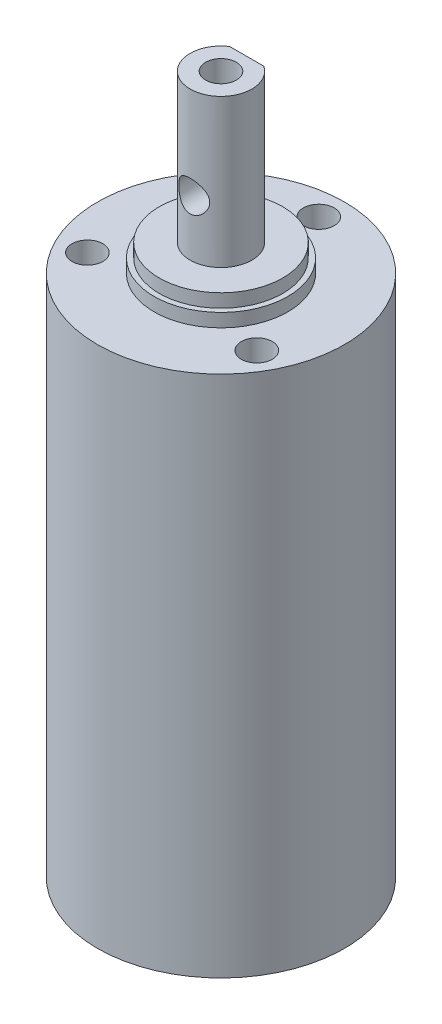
from build123d import *

# Parameters (mm, degrees)
SKETCH_2_W               = 3
SKETCH_2_H               = 14.4
SKETCH_2_H_2             = 4
CUT_EXTRUDE_1_DEPTH      = 74.778316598
CUT_EXTRUDE_1_DEPTH_BACK = 14.4
SKETCH_4_R               = 1.5
CUT_EXTRUDE_2_DEPTH      = 75.225938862
SKETCH_5_R               = 1.5
CUT_EXTRUDE_3_DEPTH      = 5.5
SKETCH_6_R               = 1.5
CUT_EXTRUDE_4_DEPTH      = 4


with BuildPart() as part:
    # Sketch 2 → Revolve 1 (revolve)
    with BuildSketch(Plane.XY, mode=Mode.PRIVATE) as revolve_1_sk:
        with Locations((1.5, 64.6)):
            Rectangle(SKETCH_2_W, SKETCH_2_H)
        Polygon((0, 57.4), (0, 56.1), (6, 56.1), (6, 57.4), (3, 57.4), align=None)
        Polygon((0, 56.1), (0, 54.8), (6.5, 54.8), (6.5, 56.1), (6, 56.1), align=None)
        Polygon((0, 54.8), (0, 4), (3, 4), (12, 4), (12, 42.6), (12, 54.8), (6.5, 54.8), align=None)
        with Locations((1.5, 2)):
            Rectangle(SKETCH_2_W, SKETCH_2_H_2)
    revolve(revolve_1_sk.sketch.rotate(Axis((0, 0, 0), (0, 1, 0)), 90), axis=Axis((0, 0, 0), (0, 1, 0)))

    # Sketch 3 → Cut-Extrude 1 (cut, two sides: drawn at the far end of the back side and taken through both)
    with BuildSketch(Plane(origin=(0, 71.8, 0), x_dir=(1, 0, 0), z_dir=(0, 1, 0)).offset(-CUT_EXTRUDE_1_DEPTH_BACK)):
        Polygon((-51.497965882, 2.5), (-1.658312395, 2.5), (1.658312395, 2.5), (51.497965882, 2.5), (51.497965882, 102.179306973), (-51.497965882, 102.179306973), align=None)
    extrude(amount=CUT_EXTRUDE_1_DEPTH + CUT_EXTRUDE_1_DEPTH_BACK, mode=Mode.SUBTRACT)

    # Sketch 4 → Cut-Extrude 2 (cut, through all)
    with BuildSketch(Plane(origin=(0, 0, -2.5), x_dir=(-1, 0, 0), z_dir=(0, 0, -1))):
        with Locations((0, 62.8)):
            Circle(SKETCH_4_R)
    extrude(amount=-CUT_EXTRUDE_2_DEPTH, mode=Mode.SUBTRACT)

    # Sketch 5 → Cut-Extrude 3 (cut)
    with BuildSketch(Plane(origin=(0, 71.8, 0), x_dir=(1, 0, 0), z_dir=(0, 1, 0))):
        with Locations(Location((0, 0, 0), (0, 0, 270))):
            Circle(SKETCH_5_R)
    extrude(amount=-CUT_EXTRUDE_3_DEPTH, mode=Mode.SUBTRACT)

    # Sketch 6 → Cut-Extrude 4 (cut)
    with BuildSketch(Plane(origin=(0, 54.8, 0), x_dir=(1, 0, 0), z_dir=(0, 1, 0))):
        with Locations(Location((0, 9.5, 0), (0, 0, 270))):
            Circle(SKETCH_6_R)
        with Locations(Location((8.227241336, -4.75, 0), (0, 0, 270))):
            Circle(SKETCH_6_R)
        with Locations(Location((-8.227241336, -4.75, 0), (0, 0, 270))):
            Circle(SKETCH_6_R)
    extrude(amount=-CUT_EXTRUDE_4_DEPTH, mode=Mode.SUBTRACT)


solid = part.part
